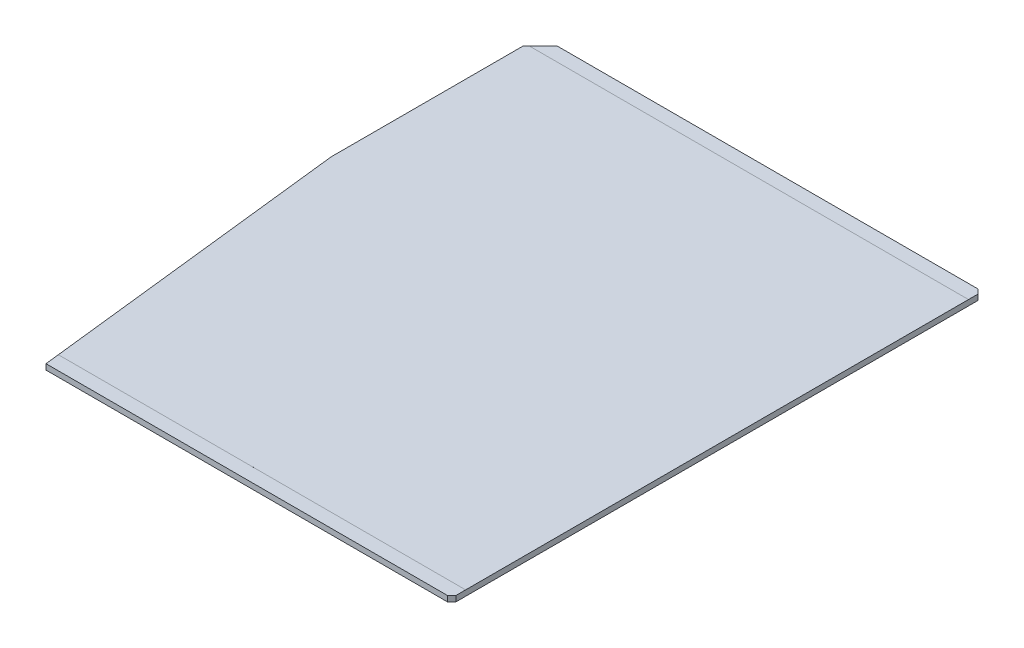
from build123d import *

# Parameters (mm, degrees)
SKETCH1_W               = 127
SKETCH1_H               = 152.4
BOSS_EXTRUDE1_DEPTH     = 1.6
CHAMFER1_SIZE           = 5
CHAMFER2_SIZE           = 1.27
SKETCH4_OUTSIDE_W       = 168.678
SKETCH4_OUTSIDE_H       = 194.078
SKETCH4_OUTSIDE_W_2     = 146.645454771
SKETCH4_OUTSIDE_H_2     = 144.4
CUT_EXTRUDE3_DEPTH      = 0.0001
CUT_EXTRUDE4_DEPTH      = 100.203074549
CUT_EXTRUDE4_DEPTH_BACK = 100.203074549


with BuildPart() as part:
    # Sketch1 → Boss-Extrude1 (new body)
    with BuildSketch(Plane(origin=(0, 0, 0), x_dir=(1, 0, 0), z_dir=(0, 1, 0))):
        Rectangle(SKETCH1_W, SKETCH1_H)
    extrude(amount=BOSS_EXTRUDE1_DEPTH)

    # Chamfer1
    chamfer1_edges = [part.edges().sort_by_distance(p)[0] for p in [
        (-63.5, 0.8, 76.2),
        (-63.5, 0.8, -76.2),
    ]]
    chamfer(chamfer1_edges, length=CHAMFER1_SIZE)

    # Chamfer2
    chamfer2_edges = [part.edges().sort_by_distance(p)[0] for p in [
        (63.5, 0.8, 76.2),
        (63.5, 0.8, -76.2),
    ]]
    chamfer(chamfer2_edges, length=CHAMFER2_SIZE)

    # Sketch4 outside → Cut-Extrude3 (cut)
    with BuildSketch(Plane(origin=(0, 1.6, 0), x_dir=(-1, 0, 0), z_dir=(0, 1, 0))):
        Rectangle(SKETCH4_OUTSIDE_W, SKETCH4_OUTSIDE_H)
        with Locations((0.842207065, 0)):
            Rectangle(SKETCH4_OUTSIDE_W_2, SKETCH4_OUTSIDE_H_2, mode=Mode.SUBTRACT)
    extrude(amount=-CUT_EXTRUDE3_DEPTH, mode=Mode.SUBTRACT)

    # Sketch5 → Cut-Extrude4 (cut, two sides: drawn at the far end of the back side and taken through both)
    with BuildSketch(Plane(origin=(0, 1.6, 0), x_dir=(1, 0, 0), z_dir=(0, 1, 0)).offset(-CUT_EXTRUDE4_DEPTH_BACK)):
        Polygon((-8.552407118, -467.338817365), (-53, -76.2), (-63.5, 16.2), (-107.947592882, 407.338817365), (-890.225227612, 318.4436316), (-790.830041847, -556.23400313), align=None)
    extrude(amount=CUT_EXTRUDE4_DEPTH + CUT_EXTRUDE4_DEPTH_BACK, mode=Mode.SUBTRACT)


solid = part.part
